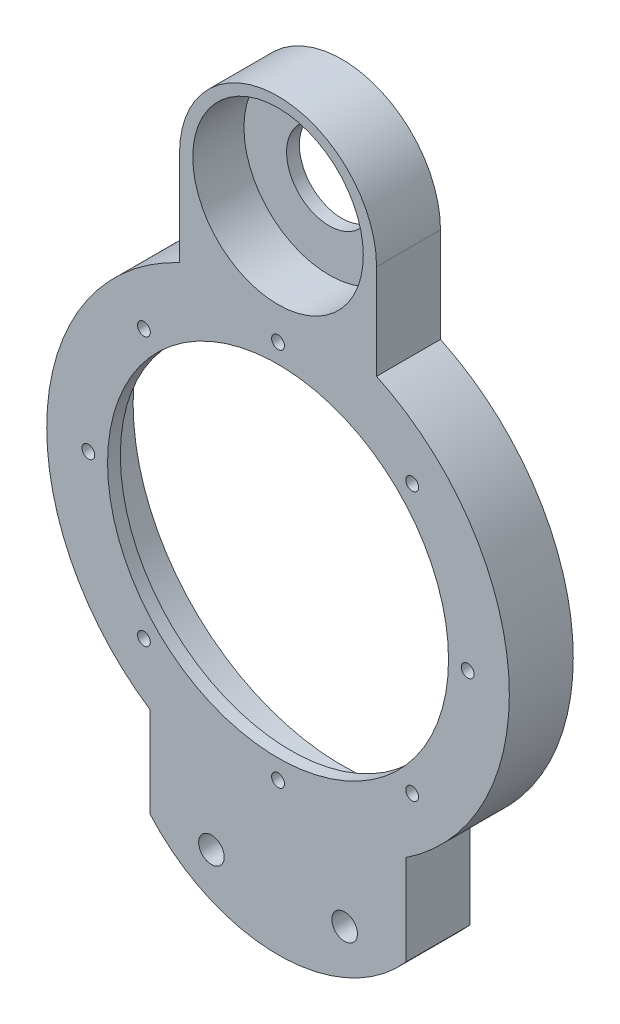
ISO-10303-21;
HEADER;
FILE_DESCRIPTION(('STEP AP214'),'2;1');
FILE_NAME('part.step','',(''),(''),'','','');
FILE_SCHEMA(('AUTOMOTIVE_DESIGN { 1 0 10303 214 1 1 1 1 }'));
ENDSEC;
DATA;
#1=APPLICATION_CONTEXT('core data for automotive mechanical design processes');
#2=APPLICATION_PROTOCOL_DEFINITION('international standard','automotive_design',2000,#1);
#3=PRODUCT_CONTEXT('',#1,'mechanical');
#4=PRODUCT('Part','Part','',(#3));
#5=PRODUCT_RELATED_PRODUCT_CATEGORY('part','',(#4));
#6=PRODUCT_DEFINITION_FORMATION('','',#4);
#7=PRODUCT_DEFINITION_CONTEXT('part definition',#1,'design');
#8=PRODUCT_DEFINITION('design','',#6,#7);
#9=PRODUCT_DEFINITION_SHAPE('','',#8);
#10=(LENGTH_UNIT() NAMED_UNIT(*) SI_UNIT(.MILLI.,.METRE.));
#11=(NAMED_UNIT(*) PLANE_ANGLE_UNIT() SI_UNIT($,.RADIAN.));
#12=(NAMED_UNIT(*) SI_UNIT($,.STERADIAN.) SOLID_ANGLE_UNIT());
#13=UNCERTAINTY_MEASURE_WITH_UNIT(LENGTH_MEASURE(1.E-05),#10,'distance_accuracy_value','');
#14=(GEOMETRIC_REPRESENTATION_CONTEXT(3) GLOBAL_UNCERTAINTY_ASSIGNED_CONTEXT((#13)) GLOBAL_UNIT_ASSIGNED_CONTEXT((#10,
#11,#12)) REPRESENTATION_CONTEXT('',''));
#15=CARTESIAN_POINT('',(0.,0.,0.));
#16=DIRECTION('',(0.,0.,1.));
#17=DIRECTION('',(1.,0.,0.));
#18=AXIS2_PLACEMENT_3D('',#15,#16,#17);
#19=CARTESIAN_POINT('',(30.,66.4575131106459,15.));
#20=DIRECTION('',(0.,0.,-1.));
#21=DIRECTION('',(-1.,0.,0.));
#22=AXIS2_PLACEMENT_3D('',#19,#20,#21);
#23=CYLINDRICAL_SURFACE('',#22,40.);
#24=CARTESIAN_POINT('',(30.,66.4575131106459,15.));
#25=DIRECTION('',(0.,0.,1.));
#26=DIRECTION('',(1.,0.,0.));
#27=AXIS2_PLACEMENT_3D('',#24,#25,#26);
#28=CIRCLE('',#27,40.);
#29=CARTESIAN_POINT('',(70.,66.4575131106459,15.));
#30=VERTEX_POINT('',#29);
#31=EDGE_CURVE('E333',#30,#30,#28,.T.);
#32=ORIENTED_EDGE('',*,*,#31,.T.);
#33=EDGE_LOOP('',(#32));
#34=FACE_BOUND('',#33,.T.);
#35=CARTESIAN_POINT('',(30.,66.4575131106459,12.));
#36=DIRECTION('',(0.,0.,-1.));
#37=DIRECTION('',(-1.,0.,0.));
#38=AXIS2_PLACEMENT_3D('',#35,#36,#37);
#39=CIRCLE('',#38,40.);
#40=CARTESIAN_POINT('',(-10.,66.4575131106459,12.));
#41=VERTEX_POINT('',#40);
#42=EDGE_CURVE('E157',#41,#41,#39,.T.);
#43=ORIENTED_EDGE('',*,*,#42,.T.);
#44=EDGE_LOOP('',(#43));
#45=FACE_BOUND('',#44,.T.);
#46=ADVANCED_FACE('F153',(#34,#45),#23,.F.);
#47=CARTESIAN_POINT('',(30.,138.577513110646,15.));
#48=DIRECTION('',(0.,0.,-1.));
#49=DIRECTION('',(-1.,0.,0.));
#50=AXIS2_PLACEMENT_3D('',#47,#48,#49);
#51=CYLINDRICAL_SURFACE('',#50,20.);
#52=CARTESIAN_POINT('',(30.,138.577513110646,15.));
#53=DIRECTION('',(0.,0.,1.));
#54=DIRECTION('',(1.,0.,0.));
#55=AXIS2_PLACEMENT_3D('',#52,#53,#54);
#56=CIRCLE('',#55,20.);
#57=CARTESIAN_POINT('',(50.,138.577513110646,15.));
#58=VERTEX_POINT('',#57);
#59=EDGE_CURVE('E262',#58,#58,#56,.T.);
#60=ORIENTED_EDGE('',*,*,#59,.T.);
#61=EDGE_LOOP('',(#60));
#62=FACE_BOUND('',#61,.T.);
#63=CARTESIAN_POINT('',(30.,138.577513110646,3.));
#64=DIRECTION('',(0.,0.,-1.));
#65=DIRECTION('',(-1.,0.,0.));
#66=AXIS2_PLACEMENT_3D('',#63,#64,#65);
#67=CIRCLE('',#66,20.);
#68=CARTESIAN_POINT('',(9.99999999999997,138.577513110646,3.));
#69=VERTEX_POINT('',#68);
#70=EDGE_CURVE('E350',#69,#69,#67,.T.);
#71=ORIENTED_EDGE('',*,*,#70,.T.);
#72=EDGE_LOOP('',(#71));
#73=FACE_BOUND('',#72,.T.);
#74=ADVANCED_FACE('F487',(#62,#73),#51,.F.);
#75=CARTESIAN_POINT('',(30.,66.4575131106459,15.));
#76=DIRECTION('',(0.,0.,1.));
#77=DIRECTION('',(1.,0.,0.));
#78=AXIS2_PLACEMENT_3D('',#75,#76,#77);
#79=PLANE('',#78);
#80=CARTESIAN_POINT('',(30.,110.957513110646,15.));
#81=DIRECTION('',(0.,0.,-1.));
#82=DIRECTION('',(-1.,0.,0.));
#83=AXIS2_PLACEMENT_3D('',#80,#81,#82);
#84=CIRCLE('',#83,1.5);
#85=CARTESIAN_POINT('',(28.5,110.957513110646,15.));
#86=VERTEX_POINT('',#85);
#87=EDGE_CURVE('E407',#86,#86,#84,.T.);
#88=ORIENTED_EDGE('',*,*,#87,.T.);
#89=EDGE_LOOP('',(#88));
#90=FACE_BOUND('',#89,.T.);
#91=CARTESIAN_POINT('',(-1.4662517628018,97.9237648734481,15.));
#92=DIRECTION('',(0.,0.,-1.));
#93=DIRECTION('',(-1.,0.,0.));
#94=AXIS2_PLACEMENT_3D('',#91,#92,#93);
#95=CIRCLE('',#94,1.50000000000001);
#96=CARTESIAN_POINT('',(-2.9662517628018,97.9237648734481,15.));
#97=VERTEX_POINT('',#96);
#98=EDGE_CURVE('E399',#97,#97,#95,.T.);
#99=ORIENTED_EDGE('',*,*,#98,.T.);
#100=EDGE_LOOP('',(#99));
#101=FACE_BOUND('',#100,.T.);
#102=CARTESIAN_POINT('',(-14.5,66.4575131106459,15.));
#103=DIRECTION('',(0.,0.,-1.));
#104=DIRECTION('',(-1.,0.,0.));
#105=AXIS2_PLACEMENT_3D('',#102,#103,#104);
#106=CIRCLE('',#105,1.49999999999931);
#107=CARTESIAN_POINT('',(-15.9999999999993,66.4575131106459,15.));
#108=VERTEX_POINT('',#107);
#109=EDGE_CURVE('E391',#108,#108,#106,.T.);
#110=ORIENTED_EDGE('',*,*,#109,.T.);
#111=EDGE_LOOP('',(#110));
#112=FACE_BOUND('',#111,.T.);
#113=CARTESIAN_POINT('',(-1.46625176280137,34.9912613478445,15.));
#114=DIRECTION('',(0.,0.,-1.));
#115=DIRECTION('',(-1.,0.,0.));
#116=AXIS2_PLACEMENT_3D('',#113,#114,#115);
#117=CIRCLE('',#116,1.49999999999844);
#118=CARTESIAN_POINT('',(-2.96625176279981,34.9912613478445,15.));
#119=VERTEX_POINT('',#118);
#120=EDGE_CURVE('E382',#119,#119,#117,.T.);
#121=ORIENTED_EDGE('',*,*,#120,.T.);
#122=EDGE_LOOP('',(#121));
#123=FACE_BOUND('',#122,.T.);
#124=CARTESIAN_POINT('',(30.,21.9575131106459,15.));
#125=DIRECTION('',(0.,0.,-1.));
#126=DIRECTION('',(-1.,0.,0.));
#127=AXIS2_PLACEMENT_3D('',#124,#125,#126);
#128=CIRCLE('',#127,1.4999999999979);
#129=CARTESIAN_POINT('',(28.5000000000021,21.9575131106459,15.));
#130=VERTEX_POINT('',#129);
#131=EDGE_CURVE('E430',#130,#130,#128,.T.);
#132=ORIENTED_EDGE('',*,*,#131,.T.);
#133=EDGE_LOOP('',(#132));
#134=FACE_BOUND('',#133,.T.);
#135=CARTESIAN_POINT('',(61.4662517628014,34.9912613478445,15.));
#136=DIRECTION('',(0.,0.,-1.));
#137=DIRECTION('',(-1.,0.,0.));
#138=AXIS2_PLACEMENT_3D('',#135,#136,#137);
#139=CIRCLE('',#138,1.4999999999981);
#140=CARTESIAN_POINT('',(59.9662517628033,34.9912613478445,15.));
#141=VERTEX_POINT('',#140);
#142=EDGE_CURVE('E422',#141,#141,#139,.T.);
#143=ORIENTED_EDGE('',*,*,#142,.T.);
#144=EDGE_LOOP('',(#143));
#145=FACE_BOUND('',#144,.T.);
#146=CARTESIAN_POINT('',(74.5,66.4575131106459,15.));
#147=DIRECTION('',(0.,0.,-1.));
#148=DIRECTION('',(-1.,0.,0.));
#149=AXIS2_PLACEMENT_3D('',#146,#147,#148);
#150=CIRCLE('',#149,1.49999999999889);
#151=CARTESIAN_POINT('',(73.0000000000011,66.4575131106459,15.));
#152=VERTEX_POINT('',#151);
#153=EDGE_CURVE('E414',#152,#152,#150,.T.);
#154=ORIENTED_EDGE('',*,*,#153,.T.);
#155=EDGE_LOOP('',(#154));
#156=FACE_BOUND('',#155,.T.);
#157=CARTESIAN_POINT('',(61.4662517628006,97.9237648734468,15.));
#158=DIRECTION('',(0.,0.,-1.));
#159=DIRECTION('',(-1.,0.,0.));
#160=AXIS2_PLACEMENT_3D('',#157,#158,#159);
#161=CIRCLE('',#160,1.50000000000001);
#162=CARTESIAN_POINT('',(59.9662517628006,97.9237648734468,15.));
#163=VERTEX_POINT('',#162);
#164=EDGE_CURVE('E370',#163,#163,#161,.T.);
#165=ORIENTED_EDGE('',*,*,#164,.T.);
#166=EDGE_LOOP('',(#165));
#167=FACE_BOUND('',#166,.T.);
#168=CARTESIAN_POINT('',(45.625,0.,15.));
#169=DIRECTION('',(0.,0.,-1.));
#170=DIRECTION('',(-1.,0.,0.));
#171=AXIS2_PLACEMENT_3D('',#168,#169,#170);
#172=CIRCLE('',#171,3.);
#173=CARTESIAN_POINT('',(42.625,0.,15.));
#174=VERTEX_POINT('',#173);
#175=EDGE_CURVE('E342',#174,#174,#172,.T.);
#176=ORIENTED_EDGE('',*,*,#175,.T.);
#177=EDGE_LOOP('',(#176));
#178=FACE_BOUND('',#177,.T.);
#179=ORIENTED_EDGE('',*,*,#31,.F.);
#180=EDGE_LOOP('',(#179));
#181=FACE_BOUND('',#180,.T.);
#182=DIRECTION('',(0.,-1.,0.));
#183=VECTOR('',#182,1.);
#184=CARTESIAN_POINT('',(6.88547195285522,137.820795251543,15.));
#185=LINE('',#184,#183);
#186=CARTESIAN_POINT('',(6.88547195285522,137.820795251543,15.));
#187=VERTEX_POINT('',#186);
#188=CARTESIAN_POINT('',(6.88547195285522,115.557729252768,15.));
#189=VERTEX_POINT('',#188);
#190=EDGE_CURVE('E285',#187,#189,#185,.T.);
#191=ORIENTED_EDGE('',*,*,#190,.T.);
#192=CARTESIAN_POINT('',(30.,66.4575131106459,15.));
#193=DIRECTION('',(0.,0.,1.));
#194=DIRECTION('',(1.,0.,0.));
#195=AXIS2_PLACEMENT_3D('',#192,#193,#194);
#196=CIRCLE('',#195,54.2688919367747);
#197=CARTESIAN_POINT('',(0.,21.2345915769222,15.));
#198=VERTEX_POINT('',#197);
#199=EDGE_CURVE('E211',#189,#198,#196,.T.);
#200=ORIENTED_EDGE('',*,*,#199,.T.);
#201=DIRECTION('',(0.,1.,0.));
#202=VECTOR('',#201,1.);
#203=CARTESIAN_POINT('',(0.,0.,15.));
#204=LINE('',#203,#202);
#205=CARTESIAN_POINT('',(0.,0.,15.));
#206=VERTEX_POINT('',#205);
#207=EDGE_CURVE('E305',#206,#198,#204,.T.);
#208=ORIENTED_EDGE('',*,*,#207,.F.);
#209=CARTESIAN_POINT('',(30.,26.4575131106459,15.));
#210=DIRECTION('',(0.,0.,1.));
#211=DIRECTION('',(1.,0.,0.));
#212=AXIS2_PLACEMENT_3D('',#209,#210,#211);
#213=CIRCLE('',#212,40.);
#214=CARTESIAN_POINT('',(60.,0.,15.));
#215=VERTEX_POINT('',#214);
#216=EDGE_CURVE('E320',#206,#215,#213,.T.);
#217=ORIENTED_EDGE('',*,*,#216,.T.);
#218=DIRECTION('',(0.,1.,0.));
#219=VECTOR('',#218,1.);
#220=CARTESIAN_POINT('',(60.,0.,15.));
#221=LINE('',#220,#219);
#222=CARTESIAN_POINT('',(60.,21.2345915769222,15.));
#223=VERTEX_POINT('',#222);
#224=EDGE_CURVE('E234',#215,#223,#221,.T.);
#225=ORIENTED_EDGE('',*,*,#224,.T.);
#226=CARTESIAN_POINT('',(30.,66.4575131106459,15.));
#227=DIRECTION('',(0.,0.,1.));
#228=DIRECTION('',(1.,0.,0.));
#229=AXIS2_PLACEMENT_3D('',#226,#227,#228);
#230=CIRCLE('',#229,54.2688919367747);
#231=CARTESIAN_POINT('',(53.1145280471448,115.557729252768,15.));
#232=VERTEX_POINT('',#231);
#233=EDGE_CURVE('E226',#223,#232,#230,.T.);
#234=ORIENTED_EDGE('',*,*,#233,.T.);
#235=DIRECTION('',(0.,1.,0.));
#236=VECTOR('',#235,1.);
#237=CARTESIAN_POINT('',(53.1145280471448,115.557729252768,15.));
#238=LINE('',#237,#236);
#239=CARTESIAN_POINT('',(53.1145280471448,137.820795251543,15.));
#240=VERTEX_POINT('',#239);
#241=EDGE_CURVE('E232',#232,#240,#238,.T.);
#242=ORIENTED_EDGE('',*,*,#241,.T.);
#243=CARTESIAN_POINT('',(30.,137.820795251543,15.));
#244=DIRECTION('',(0.,0.,-1.));
#245=DIRECTION('',(-1.,0.,0.));
#246=AXIS2_PLACEMENT_3D('',#243,#244,#245);
#247=CIRCLE('',#246,23.1145280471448);
#248=EDGE_CURVE('E252',#187,#240,#247,.T.);
#249=ORIENTED_EDGE('',*,*,#248,.F.);
#250=EDGE_LOOP('',(#191,#200,#208,#217,#225,#234,#242,#249));
#251=FACE_BOUND('',#250,.T.);
#252=ORIENTED_EDGE('',*,*,#59,.F.);
#253=EDGE_LOOP('',(#252));
#254=FACE_BOUND('',#253,.T.);
#255=CARTESIAN_POINT('',(14.375,0.,15.));
#256=DIRECTION('',(0.,0.,1.));
#257=DIRECTION('',(1.,0.,0.));
#258=AXIS2_PLACEMENT_3D('',#255,#256,#257);
#259=CIRCLE('',#258,3.);
#260=CARTESIAN_POINT('',(17.375,0.,15.));
#261=VERTEX_POINT('',#260);
#262=EDGE_CURVE('E337',#261,#261,#259,.T.);
#263=ORIENTED_EDGE('',*,*,#262,.F.);
#264=EDGE_LOOP('',(#263));
#265=FACE_BOUND('',#264,.T.);
#266=ADVANCED_FACE('F228',(#90,#101,#112,#123,#134,#145,#156,#167,#178,#181,#251,#254,#265),#79,.T.);
#267=CARTESIAN_POINT('',(30.,66.4575131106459,0.));
#268=DIRECTION('',(0.,0.,1.));
#269=DIRECTION('',(1.,0.,0.));
#270=AXIS2_PLACEMENT_3D('',#267,#268,#269);
#271=PLANE('',#270);
#272=CARTESIAN_POINT('',(30.,66.4575131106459,0.));
#273=DIRECTION('',(0.,0.,-1.));
#274=DIRECTION('',(-1.,0.,0.));
#275=AXIS2_PLACEMENT_3D('',#272,#273,#274);
#276=CIRCLE('',#275,49.);
#277=CARTESIAN_POINT('',(-19.,66.4575131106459,0.));
#278=VERTEX_POINT('',#277);
#279=EDGE_CURVE('E365',#278,#278,#276,.T.);
#280=ORIENTED_EDGE('',*,*,#279,.F.);
#281=EDGE_LOOP('',(#280));
#282=FACE_BOUND('',#281,.T.);
#283=CARTESIAN_POINT('',(45.625,0.,0.));
#284=DIRECTION('',(0.,0.,-1.));
#285=DIRECTION('',(-1.,0.,0.));
#286=AXIS2_PLACEMENT_3D('',#283,#284,#285);
#287=CIRCLE('',#286,3.);
#288=CARTESIAN_POINT('',(42.625,0.,0.));
#289=VERTEX_POINT('',#288);
#290=EDGE_CURVE('E346',#289,#289,#287,.T.);
#291=ORIENTED_EDGE('',*,*,#290,.F.);
#292=EDGE_LOOP('',(#291));
#293=FACE_BOUND('',#292,.T.);
#294=DIRECTION('',(0.,-1.,0.));
#295=VECTOR('',#294,1.);
#296=CARTESIAN_POINT('',(6.88547195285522,137.820795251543,0.));
#297=LINE('',#296,#295);
#298=CARTESIAN_POINT('',(6.88547195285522,137.820795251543,0.));
#299=VERTEX_POINT('',#298);
#300=CARTESIAN_POINT('',(6.88547195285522,115.557729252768,0.));
#301=VERTEX_POINT('',#300);
#302=EDGE_CURVE('E258',#299,#301,#297,.T.);
#303=ORIENTED_EDGE('',*,*,#302,.F.);
#304=CARTESIAN_POINT('',(30.,137.820795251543,0.));
#305=DIRECTION('',(0.,0.,-1.));
#306=DIRECTION('',(-1.,0.,0.));
#307=AXIS2_PLACEMENT_3D('',#304,#305,#306);
#308=CIRCLE('',#307,23.1145280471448);
#309=CARTESIAN_POINT('',(53.1145280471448,137.820795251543,0.));
#310=VERTEX_POINT('',#309);
#311=EDGE_CURVE('E281',#299,#310,#308,.T.);
#312=ORIENTED_EDGE('',*,*,#311,.T.);
#313=DIRECTION('',(0.,1.,0.));
#314=VECTOR('',#313,1.);
#315=CARTESIAN_POINT('',(53.1145280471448,115.557729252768,0.));
#316=LINE('',#315,#314);
#317=CARTESIAN_POINT('',(53.1145280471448,115.557729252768,0.));
#318=VERTEX_POINT('',#317);
#319=EDGE_CURVE('E278',#318,#310,#316,.T.);
#320=ORIENTED_EDGE('',*,*,#319,.F.);
#321=CARTESIAN_POINT('',(30.,66.4575131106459,0.));
#322=DIRECTION('',(0.,0.,1.));
#323=DIRECTION('',(1.,0.,0.));
#324=AXIS2_PLACEMENT_3D('',#321,#322,#323);
#325=CIRCLE('',#324,54.2688919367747);
#326=CARTESIAN_POINT('',(60.,21.2345915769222,0.));
#327=VERTEX_POINT('',#326);
#328=EDGE_CURVE('E244',#327,#318,#325,.T.);
#329=ORIENTED_EDGE('',*,*,#328,.F.);
#330=DIRECTION('',(0.,1.,0.));
#331=VECTOR('',#330,1.);
#332=CARTESIAN_POINT('',(60.,0.,0.));
#333=LINE('',#332,#331);
#334=CARTESIAN_POINT('',(60.,0.,0.));
#335=VERTEX_POINT('',#334);
#336=EDGE_CURVE('E273',#335,#327,#333,.T.);
#337=ORIENTED_EDGE('',*,*,#336,.F.);
#338=CARTESIAN_POINT('',(30.,26.4575131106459,0.));
#339=DIRECTION('',(0.,0.,1.));
#340=DIRECTION('',(1.,0.,0.));
#341=AXIS2_PLACEMENT_3D('',#338,#339,#340);
#342=CIRCLE('',#341,40.);
#343=CARTESIAN_POINT('',(0.,0.,0.));
#344=VERTEX_POINT('',#343);
#345=EDGE_CURVE('E270',#344,#335,#342,.T.);
#346=ORIENTED_EDGE('',*,*,#345,.F.);
#347=DIRECTION('',(0.,1.,0.));
#348=VECTOR('',#347,1.);
#349=CARTESIAN_POINT('',(0.,0.,0.));
#350=LINE('',#349,#348);
#351=CARTESIAN_POINT('',(0.,21.2345915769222,0.));
#352=VERTEX_POINT('',#351);
#353=EDGE_CURVE('E266',#344,#352,#350,.T.);
#354=ORIENTED_EDGE('',*,*,#353,.T.);
#355=CARTESIAN_POINT('',(30.,66.4575131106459,0.));
#356=DIRECTION('',(0.,0.,1.));
#357=DIRECTION('',(1.,0.,0.));
#358=AXIS2_PLACEMENT_3D('',#355,#356,#357);
#359=CIRCLE('',#358,54.2688919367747);
#360=EDGE_CURVE('E261',#301,#352,#359,.T.);
#361=ORIENTED_EDGE('',*,*,#360,.F.);
#362=EDGE_LOOP('',(#303,#312,#320,#329,#337,#346,#354,#361));
#363=FACE_BOUND('',#362,.T.);
#364=CARTESIAN_POINT('',(14.375,0.,0.));
#365=DIRECTION('',(0.,0.,1.));
#366=DIRECTION('',(1.,0.,0.));
#367=AXIS2_PLACEMENT_3D('',#364,#365,#366);
#368=CIRCLE('',#367,3.);
#369=CARTESIAN_POINT('',(17.375,0.,0.));
#370=VERTEX_POINT('',#369);
#371=EDGE_CURVE('E338',#370,#370,#368,.T.);
#372=ORIENTED_EDGE('',*,*,#371,.T.);
#373=EDGE_LOOP('',(#372));
#374=FACE_BOUND('',#373,.T.);
#375=CARTESIAN_POINT('',(30.,138.577513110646,0.));
#376=DIRECTION('',(0.,0.,-1.));
#377=DIRECTION('',(-1.,0.,0.));
#378=AXIS2_PLACEMENT_3D('',#375,#376,#377);
#379=CIRCLE('',#378,10.);
#380=CARTESIAN_POINT('',(20.,138.577513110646,0.));
#381=VERTEX_POINT('',#380);
#382=EDGE_CURVE('E358',#381,#381,#379,.T.);
#383=ORIENTED_EDGE('',*,*,#382,.F.);
#384=EDGE_LOOP('',(#383));
#385=FACE_BOUND('',#384,.T.);
#386=ADVANCED_FACE('F310',(#282,#293,#363,#374,#385),#271,.F.);
#387=CARTESIAN_POINT('',(6.88547195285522,137.820795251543,15.));
#388=DIRECTION('',(1.,0.,0.));
#389=DIRECTION('',(0.,1.,0.));
#390=AXIS2_PLACEMENT_3D('',#387,#388,#389);
#391=PLANE('',#390);
#392=ORIENTED_EDGE('',*,*,#302,.T.);
#393=DIRECTION('',(0.,0.,-1.));
#394=VECTOR('',#393,1.);
#395=CARTESIAN_POINT('',(6.88547195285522,115.557729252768,15.));
#396=LINE('',#395,#394);
#397=EDGE_CURVE('E12',#189,#301,#396,.T.);
#398=ORIENTED_EDGE('',*,*,#397,.F.);
#399=ORIENTED_EDGE('',*,*,#190,.F.);
#400=DIRECTION('',(0.,0.,-1.));
#401=VECTOR('',#400,1.);
#402=CARTESIAN_POINT('',(6.88547195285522,137.820795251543,15.));
#403=LINE('',#402,#401);
#404=EDGE_CURVE('E172',#187,#299,#403,.T.);
#405=ORIENTED_EDGE('',*,*,#404,.T.);
#406=EDGE_LOOP('',(#392,#398,#399,#405));
#407=FACE_BOUND('',#406,.T.);
#408=ADVANCED_FACE('F155',(#407),#391,.F.);
#409=CARTESIAN_POINT('',(30.,66.4575131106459,15.));
#410=DIRECTION('',(0.,0.,-1.));
#411=DIRECTION('',(-1.,0.,0.));
#412=AXIS2_PLACEMENT_3D('',#409,#410,#411);
#413=CYLINDRICAL_SURFACE('',#412,54.2688919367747);
#414=ORIENTED_EDGE('',*,*,#360,.T.);
#415=DIRECTION('',(0.,0.,-1.));
#416=VECTOR('',#415,1.);
#417=CARTESIAN_POINT('',(0.,21.2345915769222,15.));
#418=LINE('',#417,#416);
#419=EDGE_CURVE('E164',#198,#352,#418,.T.);
#420=ORIENTED_EDGE('',*,*,#419,.F.);
#421=ORIENTED_EDGE('',*,*,#199,.F.);
#422=ORIENTED_EDGE('',*,*,#397,.T.);
#423=EDGE_LOOP('',(#414,#420,#421,#422));
#424=FACE_BOUND('',#423,.T.);
#425=ADVANCED_FACE('F306',(#424),#413,.T.);
#426=CARTESIAN_POINT('',(0.,0.,15.));
#427=DIRECTION('',(-1.,0.,0.));
#428=DIRECTION('',(0.,-1.,0.));
#429=AXIS2_PLACEMENT_3D('',#426,#427,#428);
#430=PLANE('',#429);
#431=ORIENTED_EDGE('',*,*,#353,.F.);
#432=DIRECTION('',(0.,0.,-1.));
#433=VECTOR('',#432,1.);
#434=CARTESIAN_POINT('',(0.,0.,15.));
#435=LINE('',#434,#433);
#436=EDGE_CURVE('E296',#206,#344,#435,.T.);
#437=ORIENTED_EDGE('',*,*,#436,.F.);
#438=ORIENTED_EDGE('',*,*,#207,.T.);
#439=ORIENTED_EDGE('',*,*,#419,.T.);
#440=EDGE_LOOP('',(#431,#437,#438,#439));
#441=FACE_BOUND('',#440,.T.);
#442=ADVANCED_FACE('F303',(#441),#430,.T.);
#443=CARTESIAN_POINT('',(30.,26.4575131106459,15.));
#444=DIRECTION('',(0.,0.,-1.));
#445=DIRECTION('',(-1.,0.,0.));
#446=AXIS2_PLACEMENT_3D('',#443,#444,#445);
#447=CYLINDRICAL_SURFACE('',#446,40.);
#448=ORIENTED_EDGE('',*,*,#345,.T.);
#449=DIRECTION('',(0.,0.,-1.));
#450=VECTOR('',#449,1.);
#451=CARTESIAN_POINT('',(60.,0.,15.));
#452=LINE('',#451,#450);
#453=EDGE_CURVE('E292',#215,#335,#452,.T.);
#454=ORIENTED_EDGE('',*,*,#453,.F.);
#455=ORIENTED_EDGE('',*,*,#216,.F.);
#456=ORIENTED_EDGE('',*,*,#436,.T.);
#457=EDGE_LOOP('',(#448,#454,#455,#456));
#458=FACE_BOUND('',#457,.T.);
#459=ADVANCED_FACE('F315',(#458),#447,.T.);
#460=CARTESIAN_POINT('',(60.,0.,15.));
#461=DIRECTION('',(-1.,0.,0.));
#462=DIRECTION('',(0.,0.,1.));
#463=AXIS2_PLACEMENT_3D('',#460,#461,#462);
#464=PLANE('',#463);
#465=ORIENTED_EDGE('',*,*,#336,.T.);
#466=DIRECTION('',(0.,0.,-1.));
#467=VECTOR('',#466,1.);
#468=CARTESIAN_POINT('',(60.,21.2345915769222,15.));
#469=LINE('',#468,#467);
#470=EDGE_CURVE('E248',#223,#327,#469,.T.);
#471=ORIENTED_EDGE('',*,*,#470,.F.);
#472=ORIENTED_EDGE('',*,*,#224,.F.);
#473=ORIENTED_EDGE('',*,*,#453,.T.);
#474=EDGE_LOOP('',(#465,#471,#472,#473));
#475=FACE_BOUND('',#474,.T.);
#476=ADVANCED_FACE('F318',(#475),#464,.F.);
#477=CARTESIAN_POINT('',(30.,66.4575131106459,15.));
#478=DIRECTION('',(0.,0.,-1.));
#479=DIRECTION('',(-1.,0.,0.));
#480=AXIS2_PLACEMENT_3D('',#477,#478,#479);
#481=CYLINDRICAL_SURFACE('',#480,54.2688919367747);
#482=ORIENTED_EDGE('',*,*,#328,.T.);
#483=DIRECTION('',(0.,0.,-1.));
#484=VECTOR('',#483,1.);
#485=CARTESIAN_POINT('',(53.1145280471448,115.557729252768,15.));
#486=LINE('',#485,#484);
#487=EDGE_CURVE('E241',#232,#318,#486,.T.);
#488=ORIENTED_EDGE('',*,*,#487,.F.);
#489=ORIENTED_EDGE('',*,*,#233,.F.);
#490=ORIENTED_EDGE('',*,*,#470,.T.);
#491=EDGE_LOOP('',(#482,#488,#489,#490));
#492=FACE_BOUND('',#491,.T.);
#493=ADVANCED_FACE('F242',(#492),#481,.T.);
#494=CARTESIAN_POINT('',(53.1145280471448,115.557729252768,15.));
#495=DIRECTION('',(-1.,0.,0.));
#496=DIRECTION('',(0.,0.,1.));
#497=AXIS2_PLACEMENT_3D('',#494,#495,#496);
#498=PLANE('',#497);
#499=ORIENTED_EDGE('',*,*,#319,.T.);
#500=DIRECTION('',(0.,0.,-1.));
#501=VECTOR('',#500,1.);
#502=CARTESIAN_POINT('',(53.1145280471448,137.820795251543,15.));
#503=LINE('',#502,#501);
#504=EDGE_CURVE('E199',#240,#310,#503,.T.);
#505=ORIENTED_EDGE('',*,*,#504,.F.);
#506=ORIENTED_EDGE('',*,*,#241,.F.);
#507=ORIENTED_EDGE('',*,*,#487,.T.);
#508=EDGE_LOOP('',(#499,#505,#506,#507));
#509=FACE_BOUND('',#508,.T.);
#510=ADVANCED_FACE('F250',(#509),#498,.F.);
#511=CARTESIAN_POINT('',(30.,137.820795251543,15.));
#512=DIRECTION('',(0.,0.,-1.));
#513=DIRECTION('',(-1.,0.,0.));
#514=AXIS2_PLACEMENT_3D('',#511,#512,#513);
#515=CYLINDRICAL_SURFACE('',#514,23.1145280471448);
#516=ORIENTED_EDGE('',*,*,#311,.F.);
#517=ORIENTED_EDGE('',*,*,#404,.F.);
#518=ORIENTED_EDGE('',*,*,#248,.T.);
#519=ORIENTED_EDGE('',*,*,#504,.T.);
#520=EDGE_LOOP('',(#516,#517,#518,#519));
#521=FACE_BOUND('',#520,.T.);
#522=ADVANCED_FACE('F482',(#521),#515,.T.);
#523=CARTESIAN_POINT('',(14.375,0.,15.));
#524=DIRECTION('',(0.,0.,-1.));
#525=DIRECTION('',(-1.,0.,0.));
#526=AXIS2_PLACEMENT_3D('',#523,#524,#525);
#527=CYLINDRICAL_SURFACE('',#526,3.);
#528=ORIENTED_EDGE('',*,*,#262,.T.);
#529=EDGE_LOOP('',(#528));
#530=FACE_BOUND('',#529,.T.);
#531=ORIENTED_EDGE('',*,*,#371,.F.);
#532=EDGE_LOOP('',(#531));
#533=FACE_BOUND('',#532,.T.);
#534=ADVANCED_FACE('F472',(#530,#533),#527,.F.);
#535=CARTESIAN_POINT('',(45.625,0.,15.));
#536=DIRECTION('',(0.,0.,-1.));
#537=DIRECTION('',(-1.,0.,0.));
#538=AXIS2_PLACEMENT_3D('',#535,#536,#537);
#539=CYLINDRICAL_SURFACE('',#538,3.);
#540=ORIENTED_EDGE('',*,*,#175,.F.);
#541=EDGE_LOOP('',(#540));
#542=FACE_BOUND('',#541,.T.);
#543=ORIENTED_EDGE('',*,*,#290,.T.);
#544=EDGE_LOOP('',(#543));
#545=FACE_BOUND('',#544,.T.);
#546=ADVANCED_FACE('F469',(#542,#545),#539,.F.);
#547=CARTESIAN_POINT('',(30.,138.577513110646,3.));
#548=DIRECTION('',(0.,0.,-1.));
#549=DIRECTION('',(-1.,0.,0.));
#550=AXIS2_PLACEMENT_3D('',#547,#548,#549);
#551=PLANE('',#550);
#552=CARTESIAN_POINT('',(30.,138.577513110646,3.));
#553=DIRECTION('',(0.,0.,-1.));
#554=DIRECTION('',(-1.,0.,0.));
#555=AXIS2_PLACEMENT_3D('',#552,#553,#554);
#556=CIRCLE('',#555,10.);
#557=CARTESIAN_POINT('',(20.,138.577513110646,3.));
#558=VERTEX_POINT('',#557);
#559=EDGE_CURVE('E357',#558,#558,#556,.T.);
#560=ORIENTED_EDGE('',*,*,#559,.T.);
#561=EDGE_LOOP('',(#560));
#562=FACE_BOUND('',#561,.T.);
#563=ORIENTED_EDGE('',*,*,#70,.F.);
#564=EDGE_LOOP('',(#563));
#565=FACE_BOUND('',#564,.T.);
#566=ADVANCED_FACE('F471',(#562,#565),#551,.F.);
#567=CARTESIAN_POINT('',(30.,138.577513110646,3.));
#568=DIRECTION('',(0.,0.,-1.));
#569=DIRECTION('',(-1.,0.,0.));
#570=AXIS2_PLACEMENT_3D('',#567,#568,#569);
#571=CYLINDRICAL_SURFACE('',#570,10.);
#572=ORIENTED_EDGE('',*,*,#559,.F.);
#573=EDGE_LOOP('',(#572));
#574=FACE_BOUND('',#573,.T.);
#575=ORIENTED_EDGE('',*,*,#382,.T.);
#576=EDGE_LOOP('',(#575));
#577=FACE_BOUND('',#576,.T.);
#578=ADVANCED_FACE('F460',(#574,#577),#571,.F.);
#579=CARTESIAN_POINT('',(30.,66.4575131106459,12.));
#580=DIRECTION('',(0.,0.,-1.));
#581=DIRECTION('',(-1.,0.,0.));
#582=AXIS2_PLACEMENT_3D('',#579,#580,#581);
#583=CYLINDRICAL_SURFACE('',#582,49.);
#584=CARTESIAN_POINT('',(30.,66.4575131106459,12.));
#585=DIRECTION('',(0.,0.,-1.));
#586=DIRECTION('',(-1.,0.,0.));
#587=AXIS2_PLACEMENT_3D('',#584,#585,#586);
#588=CIRCLE('',#587,49.);
#589=CARTESIAN_POINT('',(-19.,66.4575131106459,12.));
#590=VERTEX_POINT('',#589);
#591=EDGE_CURVE('E369',#590,#590,#588,.T.);
#592=ORIENTED_EDGE('',*,*,#591,.F.);
#593=EDGE_LOOP('',(#592));
#594=FACE_BOUND('',#593,.T.);
#595=ORIENTED_EDGE('',*,*,#279,.T.);
#596=EDGE_LOOP('',(#595));
#597=FACE_BOUND('',#596,.T.);
#598=ADVANCED_FACE('F444',(#594,#597),#583,.F.);
#599=CARTESIAN_POINT('',(30.,66.4575131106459,12.));
#600=DIRECTION('',(0.,0.,-1.));
#601=DIRECTION('',(-1.,0.,0.));
#602=AXIS2_PLACEMENT_3D('',#599,#600,#601);
#603=PLANE('',#602);
#604=CARTESIAN_POINT('',(30.,110.957513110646,12.));
#605=DIRECTION('',(0.,0.,-1.));
#606=DIRECTION('',(-1.,0.,0.));
#607=AXIS2_PLACEMENT_3D('',#604,#605,#606);
#608=CIRCLE('',#607,1.5);
#609=CARTESIAN_POINT('',(28.5,110.957513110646,12.));
#610=VERTEX_POINT('',#609);
#611=EDGE_CURVE('E378',#610,#610,#608,.T.);
#612=ORIENTED_EDGE('',*,*,#611,.F.);
#613=EDGE_LOOP('',(#612));
#614=FACE_BOUND('',#613,.T.);
#615=CARTESIAN_POINT('',(-1.4662517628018,97.9237648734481,12.));
#616=DIRECTION('',(0.,0.,-1.));
#617=DIRECTION('',(-1.,0.,0.));
#618=AXIS2_PLACEMENT_3D('',#615,#616,#617);
#619=CIRCLE('',#618,1.50000000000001);
#620=CARTESIAN_POINT('',(-2.9662517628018,97.9237648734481,12.));
#621=VERTEX_POINT('',#620);
#622=EDGE_CURVE('E403',#621,#621,#619,.T.);
#623=ORIENTED_EDGE('',*,*,#622,.F.);
#624=EDGE_LOOP('',(#623));
#625=FACE_BOUND('',#624,.T.);
#626=CARTESIAN_POINT('',(-14.5,66.4575131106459,12.));
#627=DIRECTION('',(0.,0.,-1.));
#628=DIRECTION('',(-1.,0.,0.));
#629=AXIS2_PLACEMENT_3D('',#626,#627,#628);
#630=CIRCLE('',#629,1.49999999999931);
#631=CARTESIAN_POINT('',(-15.9999999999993,66.4575131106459,12.));
#632=VERTEX_POINT('',#631);
#633=EDGE_CURVE('E395',#632,#632,#630,.T.);
#634=ORIENTED_EDGE('',*,*,#633,.F.);
#635=EDGE_LOOP('',(#634));
#636=FACE_BOUND('',#635,.T.);
#637=CARTESIAN_POINT('',(-1.46625176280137,34.9912613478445,12.));
#638=DIRECTION('',(0.,0.,-1.));
#639=DIRECTION('',(-1.,0.,0.));
#640=AXIS2_PLACEMENT_3D('',#637,#638,#639);
#641=CIRCLE('',#640,1.49999999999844);
#642=CARTESIAN_POINT('',(-2.96625176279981,34.9912613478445,12.));
#643=VERTEX_POINT('',#642);
#644=EDGE_CURVE('E386',#643,#643,#641,.T.);
#645=ORIENTED_EDGE('',*,*,#644,.F.);
#646=EDGE_LOOP('',(#645));
#647=FACE_BOUND('',#646,.T.);
#648=CARTESIAN_POINT('',(30.,21.9575131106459,12.));
#649=DIRECTION('',(0.,0.,-1.));
#650=DIRECTION('',(-1.,0.,0.));
#651=AXIS2_PLACEMENT_3D('',#648,#649,#650);
#652=CIRCLE('',#651,1.4999999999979);
#653=CARTESIAN_POINT('',(28.5000000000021,21.9575131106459,12.));
#654=VERTEX_POINT('',#653);
#655=EDGE_CURVE('E387',#654,#654,#652,.T.);
#656=ORIENTED_EDGE('',*,*,#655,.F.);
#657=EDGE_LOOP('',(#656));
#658=FACE_BOUND('',#657,.T.);
#659=CARTESIAN_POINT('',(61.4662517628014,34.9912613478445,12.));
#660=DIRECTION('',(0.,0.,-1.));
#661=DIRECTION('',(-1.,0.,0.));
#662=AXIS2_PLACEMENT_3D('',#659,#660,#661);
#663=CIRCLE('',#662,1.4999999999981);
#664=CARTESIAN_POINT('',(59.9662517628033,34.9912613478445,12.));
#665=VERTEX_POINT('',#664);
#666=EDGE_CURVE('E426',#665,#665,#663,.T.);
#667=ORIENTED_EDGE('',*,*,#666,.F.);
#668=EDGE_LOOP('',(#667));
#669=FACE_BOUND('',#668,.T.);
#670=CARTESIAN_POINT('',(74.5,66.4575131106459,12.));
#671=DIRECTION('',(0.,0.,-1.));
#672=DIRECTION('',(-1.,0.,0.));
#673=AXIS2_PLACEMENT_3D('',#670,#671,#672);
#674=CIRCLE('',#673,1.49999999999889);
#675=CARTESIAN_POINT('',(73.0000000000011,66.4575131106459,12.));
#676=VERTEX_POINT('',#675);
#677=EDGE_CURVE('E418',#676,#676,#674,.T.);
#678=ORIENTED_EDGE('',*,*,#677,.F.);
#679=EDGE_LOOP('',(#678));
#680=FACE_BOUND('',#679,.T.);
#681=CARTESIAN_POINT('',(61.4662517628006,97.9237648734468,12.));
#682=DIRECTION('',(0.,0.,-1.));
#683=DIRECTION('',(-1.,0.,0.));
#684=AXIS2_PLACEMENT_3D('',#681,#682,#683);
#685=CIRCLE('',#684,1.50000000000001);
#686=CARTESIAN_POINT('',(59.9662517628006,97.9237648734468,12.));
#687=VERTEX_POINT('',#686);
#688=EDGE_CURVE('E374',#687,#687,#685,.T.);
#689=ORIENTED_EDGE('',*,*,#688,.F.);
#690=EDGE_LOOP('',(#689));
#691=FACE_BOUND('',#690,.T.);
#692=ORIENTED_EDGE('',*,*,#42,.F.);
#693=EDGE_LOOP('',(#692));
#694=FACE_BOUND('',#693,.T.);
#695=ORIENTED_EDGE('',*,*,#591,.T.);
#696=EDGE_LOOP('',(#695));
#697=FACE_BOUND('',#696,.T.);
#698=ADVANCED_FACE('F440',(#614,#625,#636,#647,#658,#669,#680,#691,#694,#697),#603,.T.);
#699=CARTESIAN_POINT('',(61.4662517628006,97.9237648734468,15.));
#700=DIRECTION('',(0.,0.,-1.));
#701=DIRECTION('',(-1.,0.,0.));
#702=AXIS2_PLACEMENT_3D('',#699,#700,#701);
#703=CYLINDRICAL_SURFACE('',#702,1.50000000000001);
#704=ORIENTED_EDGE('',*,*,#164,.F.);
#705=EDGE_LOOP('',(#704));
#706=FACE_BOUND('',#705,.T.);
#707=ORIENTED_EDGE('',*,*,#688,.T.);
#708=EDGE_LOOP('',(#707));
#709=FACE_BOUND('',#708,.T.);
#710=ADVANCED_FACE('F443',(#706,#709),#703,.F.);
#711=CARTESIAN_POINT('',(74.5,66.4575131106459,15.));
#712=DIRECTION('',(0.,0.,-1.));
#713=DIRECTION('',(-1.,0.,0.));
#714=AXIS2_PLACEMENT_3D('',#711,#712,#713);
#715=CYLINDRICAL_SURFACE('',#714,1.49999999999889);
#716=ORIENTED_EDGE('',*,*,#153,.F.);
#717=EDGE_LOOP('',(#716));
#718=FACE_BOUND('',#717,.T.);
#719=ORIENTED_EDGE('',*,*,#677,.T.);
#720=EDGE_LOOP('',(#719));
#721=FACE_BOUND('',#720,.T.);
#722=ADVANCED_FACE('F621',(#718,#721),#715,.F.);
#723=CARTESIAN_POINT('',(61.4662517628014,34.9912613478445,15.));
#724=DIRECTION('',(0.,0.,-1.));
#725=DIRECTION('',(-1.,0.,0.));
#726=AXIS2_PLACEMENT_3D('',#723,#724,#725);
#727=CYLINDRICAL_SURFACE('',#726,1.4999999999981);
#728=ORIENTED_EDGE('',*,*,#142,.F.);
#729=EDGE_LOOP('',(#728));
#730=FACE_BOUND('',#729,.T.);
#731=ORIENTED_EDGE('',*,*,#666,.T.);
#732=EDGE_LOOP('',(#731));
#733=FACE_BOUND('',#732,.T.);
#734=ADVANCED_FACE('F631',(#730,#733),#727,.F.);
#735=CARTESIAN_POINT('',(30.,21.9575131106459,15.));
#736=DIRECTION('',(0.,0.,-1.));
#737=DIRECTION('',(-1.,0.,0.));
#738=AXIS2_PLACEMENT_3D('',#735,#736,#737);
#739=CYLINDRICAL_SURFACE('',#738,1.4999999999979);
#740=ORIENTED_EDGE('',*,*,#131,.F.);
#741=EDGE_LOOP('',(#740));
#742=FACE_BOUND('',#741,.T.);
#743=ORIENTED_EDGE('',*,*,#655,.T.);
#744=EDGE_LOOP('',(#743));
#745=FACE_BOUND('',#744,.T.);
#746=ADVANCED_FACE('F438',(#742,#745),#739,.F.);
#747=CARTESIAN_POINT('',(-1.46625176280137,34.9912613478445,15.));
#748=DIRECTION('',(0.,0.,-1.));
#749=DIRECTION('',(-1.,0.,0.));
#750=AXIS2_PLACEMENT_3D('',#747,#748,#749);
#751=CYLINDRICAL_SURFACE('',#750,1.49999999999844);
#752=ORIENTED_EDGE('',*,*,#120,.F.);
#753=EDGE_LOOP('',(#752));
#754=FACE_BOUND('',#753,.T.);
#755=ORIENTED_EDGE('',*,*,#644,.T.);
#756=EDGE_LOOP('',(#755));
#757=FACE_BOUND('',#756,.T.);
#758=ADVANCED_FACE('F650',(#754,#757),#751,.F.);
#759=CARTESIAN_POINT('',(-14.5,66.4575131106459,15.));
#760=DIRECTION('',(0.,0.,-1.));
#761=DIRECTION('',(-1.,0.,0.));
#762=AXIS2_PLACEMENT_3D('',#759,#760,#761);
#763=CYLINDRICAL_SURFACE('',#762,1.49999999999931);
#764=ORIENTED_EDGE('',*,*,#109,.F.);
#765=EDGE_LOOP('',(#764));
#766=FACE_BOUND('',#765,.T.);
#767=ORIENTED_EDGE('',*,*,#633,.T.);
#768=EDGE_LOOP('',(#767));
#769=FACE_BOUND('',#768,.T.);
#770=ADVANCED_FACE('F660',(#766,#769),#763,.F.);
#771=CARTESIAN_POINT('',(-1.4662517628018,97.9237648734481,15.));
#772=DIRECTION('',(0.,0.,-1.));
#773=DIRECTION('',(-1.,0.,0.));
#774=AXIS2_PLACEMENT_3D('',#771,#772,#773);
#775=CYLINDRICAL_SURFACE('',#774,1.50000000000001);
#776=ORIENTED_EDGE('',*,*,#98,.F.);
#777=EDGE_LOOP('',(#776));
#778=FACE_BOUND('',#777,.T.);
#779=ORIENTED_EDGE('',*,*,#622,.T.);
#780=EDGE_LOOP('',(#779));
#781=FACE_BOUND('',#780,.T.);
#782=ADVANCED_FACE('F670',(#778,#781),#775,.F.);
#783=CARTESIAN_POINT('',(30.,110.957513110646,15.));
#784=DIRECTION('',(0.,0.,-1.));
#785=DIRECTION('',(-1.,0.,0.));
#786=AXIS2_PLACEMENT_3D('',#783,#784,#785);
#787=CYLINDRICAL_SURFACE('',#786,1.5);
#788=ORIENTED_EDGE('',*,*,#87,.F.);
#789=EDGE_LOOP('',(#788));
#790=FACE_BOUND('',#789,.T.);
#791=ORIENTED_EDGE('',*,*,#611,.T.);
#792=EDGE_LOOP('',(#791));
#793=FACE_BOUND('',#792,.T.);
#794=ADVANCED_FACE('F680',(#790,#793),#787,.F.);
#795=CLOSED_SHELL('',(#46,#74,#266,#386,#408,#425,#442,#459,#476,#493,#510,#522,#534,#546,#566,
#578,#598,#698,#710,#722,#734,#746,#758,#770,#782,#794));
#796=MANIFOLD_SOLID_BREP('B2',#795);
#797=ADVANCED_BREP_SHAPE_REPRESENTATION('',(#18,#796),#14);
#798=SHAPE_DEFINITION_REPRESENTATION(#9,#797);
ENDSEC;
END-ISO-10303-21;
